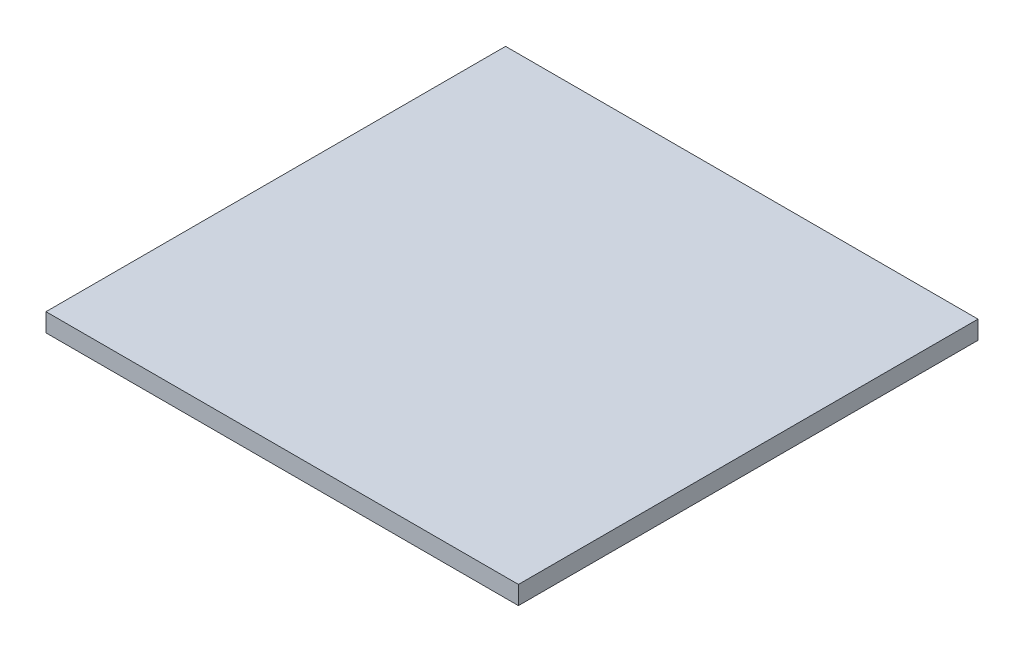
ISO-10303-21;
HEADER;
FILE_DESCRIPTION(('STEP AP214'),'2;1');
FILE_NAME('part.step','',(''),(''),'','','');
FILE_SCHEMA(('AUTOMOTIVE_DESIGN { 1 0 10303 214 1 1 1 1 }'));
ENDSEC;
DATA;
#1=APPLICATION_CONTEXT('core data for automotive mechanical design processes');
#2=APPLICATION_PROTOCOL_DEFINITION('international standard','automotive_design',2000,#1);
#3=PRODUCT_CONTEXT('',#1,'mechanical');
#4=PRODUCT('Part','Part','',(#3));
#5=PRODUCT_RELATED_PRODUCT_CATEGORY('part','',(#4));
#6=PRODUCT_DEFINITION_FORMATION('','',#4);
#7=PRODUCT_DEFINITION_CONTEXT('part definition',#1,'design');
#8=PRODUCT_DEFINITION('design','',#6,#7);
#9=PRODUCT_DEFINITION_SHAPE('','',#8);
#10=(LENGTH_UNIT() NAMED_UNIT(*) SI_UNIT(.MILLI.,.METRE.));
#11=(NAMED_UNIT(*) PLANE_ANGLE_UNIT() SI_UNIT($,.RADIAN.));
#12=(NAMED_UNIT(*) SI_UNIT($,.STERADIAN.) SOLID_ANGLE_UNIT());
#13=UNCERTAINTY_MEASURE_WITH_UNIT(LENGTH_MEASURE(1.E-05),#10,'distance_accuracy_value','');
#14=(GEOMETRIC_REPRESENTATION_CONTEXT(3) GLOBAL_UNCERTAINTY_ASSIGNED_CONTEXT((#13)) GLOBAL_UNIT_ASSIGNED_CONTEXT((#10,
#11,#12)) REPRESENTATION_CONTEXT('',''));
#15=CARTESIAN_POINT('',(0.,0.,0.));
#16=DIRECTION('',(0.,0.,1.));
#17=DIRECTION('',(1.,0.,0.));
#18=AXIS2_PLACEMENT_3D('',#15,#16,#17);
#19=CARTESIAN_POINT('',(-12.9723587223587,1.,15.9103194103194));
#20=DIRECTION('',(1.,0.,0.));
#21=DIRECTION('',(0.,0.,-1.));
#22=AXIS2_PLACEMENT_3D('',#19,#20,#21);
#23=PLANE('',#22);
#24=DIRECTION('',(0.,0.,1.));
#25=VECTOR('',#24,1.);
#26=CARTESIAN_POINT('',(-12.9723587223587,0.,15.9103194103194));
#27=LINE('',#26,#25);
#28=CARTESIAN_POINT('',(-12.9723587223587,0.,-9.08968058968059));
#29=VERTEX_POINT('',#28);
#30=CARTESIAN_POINT('',(-12.9723587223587,0.,15.9103194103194));
#31=VERTEX_POINT('',#30);
#32=EDGE_CURVE('E95',#29,#31,#27,.T.);
#33=ORIENTED_EDGE('',*,*,#32,.T.);
#34=DIRECTION('',(0.,-1.,0.));
#35=VECTOR('',#34,1.);
#36=CARTESIAN_POINT('',(-12.9723587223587,1.,15.9103194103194));
#37=LINE('',#36,#35);
#38=CARTESIAN_POINT('',(-12.9723587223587,1.,15.9103194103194));
#39=VERTEX_POINT('',#38);
#40=EDGE_CURVE('E11',#39,#31,#37,.T.);
#41=ORIENTED_EDGE('',*,*,#40,.F.);
#42=DIRECTION('',(0.,0.,1.));
#43=VECTOR('',#42,1.);
#44=CARTESIAN_POINT('',(-12.9723587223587,1.,15.9103194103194));
#45=LINE('',#44,#43);
#46=CARTESIAN_POINT('',(-12.9723587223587,1.,-9.08968058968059));
#47=VERTEX_POINT('',#46);
#48=EDGE_CURVE('E83',#47,#39,#45,.T.);
#49=ORIENTED_EDGE('',*,*,#48,.F.);
#50=DIRECTION('',(0.,-1.,0.));
#51=VECTOR('',#50,1.);
#52=CARTESIAN_POINT('',(-12.9723587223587,1.,-9.08968058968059));
#53=LINE('',#52,#51);
#54=EDGE_CURVE('E91',#47,#29,#53,.T.);
#55=ORIENTED_EDGE('',*,*,#54,.T.);
#56=EDGE_LOOP('',(#33,#41,#49,#55));
#57=FACE_BOUND('',#56,.T.);
#58=ADVANCED_FACE('F32',(#57),#23,.F.);
#59=CARTESIAN_POINT('',(-12.9723587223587,1.,15.9103194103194));
#60=DIRECTION('',(0.,0.,-1.));
#61=DIRECTION('',(-1.,0.,0.));
#62=AXIS2_PLACEMENT_3D('',#59,#60,#61);
#63=PLANE('',#62);
#64=DIRECTION('',(1.,0.,0.));
#65=VECTOR('',#64,1.);
#66=CARTESIAN_POINT('',(-12.9723587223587,0.,15.9103194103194));
#67=LINE('',#66,#65);
#68=CARTESIAN_POINT('',(12.7276412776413,0.,15.9103194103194));
#69=VERTEX_POINT('',#68);
#70=EDGE_CURVE('E87',#31,#69,#67,.T.);
#71=ORIENTED_EDGE('',*,*,#70,.T.);
#72=DIRECTION('',(0.,-1.,0.));
#73=VECTOR('',#72,1.);
#74=CARTESIAN_POINT('',(12.7276412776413,1.,15.9103194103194));
#75=LINE('',#74,#73);
#76=CARTESIAN_POINT('',(12.7276412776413,1.,15.9103194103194));
#77=VERTEX_POINT('',#76);
#78=EDGE_CURVE('E40',#77,#69,#75,.T.);
#79=ORIENTED_EDGE('',*,*,#78,.F.);
#80=DIRECTION('',(1.,0.,0.));
#81=VECTOR('',#80,1.);
#82=CARTESIAN_POINT('',(-12.9723587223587,1.,15.9103194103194));
#83=LINE('',#82,#81);
#84=EDGE_CURVE('E78',#39,#77,#83,.T.);
#85=ORIENTED_EDGE('',*,*,#84,.F.);
#86=ORIENTED_EDGE('',*,*,#40,.T.);
#87=EDGE_LOOP('',(#71,#79,#85,#86));
#88=FACE_BOUND('',#87,.T.);
#89=ADVANCED_FACE('F86',(#88),#63,.F.);
#90=CARTESIAN_POINT('',(12.7276412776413,1.,15.9103194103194));
#91=DIRECTION('',(-1.,0.,0.));
#92=DIRECTION('',(0.,0.,1.));
#93=AXIS2_PLACEMENT_3D('',#90,#91,#92);
#94=PLANE('',#93);
#95=DIRECTION('',(0.,0.,-1.));
#96=VECTOR('',#95,1.);
#97=CARTESIAN_POINT('',(12.7276412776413,0.,15.9103194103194));
#98=LINE('',#97,#96);
#99=CARTESIAN_POINT('',(12.7276412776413,0.,-9.08968058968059));
#100=VERTEX_POINT('',#99);
#101=EDGE_CURVE('E65',#69,#100,#98,.T.);
#102=ORIENTED_EDGE('',*,*,#101,.T.);
#103=DIRECTION('',(0.,-1.,0.));
#104=VECTOR('',#103,1.);
#105=CARTESIAN_POINT('',(12.7276412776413,1.,-9.08968058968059));
#106=LINE('',#105,#104);
#107=CARTESIAN_POINT('',(12.7276412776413,1.,-9.08968058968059));
#108=VERTEX_POINT('',#107);
#109=EDGE_CURVE('E88',#108,#100,#106,.T.);
#110=ORIENTED_EDGE('',*,*,#109,.F.);
#111=DIRECTION('',(0.,0.,-1.));
#112=VECTOR('',#111,1.);
#113=CARTESIAN_POINT('',(12.7276412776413,1.,15.9103194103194));
#114=LINE('',#113,#112);
#115=EDGE_CURVE('E81',#77,#108,#114,.T.);
#116=ORIENTED_EDGE('',*,*,#115,.F.);
#117=ORIENTED_EDGE('',*,*,#78,.T.);
#118=EDGE_LOOP('',(#102,#110,#116,#117));
#119=FACE_BOUND('',#118,.T.);
#120=ADVANCED_FACE('F89',(#119),#94,.F.);
#121=CARTESIAN_POINT('',(-12.9723587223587,1.,-9.08968058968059));
#122=DIRECTION('',(0.,0.,1.));
#123=DIRECTION('',(1.,0.,0.));
#124=AXIS2_PLACEMENT_3D('',#121,#122,#123);
#125=PLANE('',#124);
#126=DIRECTION('',(-1.,0.,0.));
#127=VECTOR('',#126,1.);
#128=CARTESIAN_POINT('',(-12.9723587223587,0.,-9.08968058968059));
#129=LINE('',#128,#127);
#130=EDGE_CURVE('E71',#100,#29,#129,.T.);
#131=ORIENTED_EDGE('',*,*,#130,.T.);
#132=ORIENTED_EDGE('',*,*,#54,.F.);
#133=DIRECTION('',(-1.,0.,0.));
#134=VECTOR('',#133,1.);
#135=CARTESIAN_POINT('',(-12.9723587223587,1.,-9.08968058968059));
#136=LINE('',#135,#134);
#137=EDGE_CURVE('E48',#108,#47,#136,.T.);
#138=ORIENTED_EDGE('',*,*,#137,.F.);
#139=ORIENTED_EDGE('',*,*,#109,.T.);
#140=EDGE_LOOP('',(#131,#132,#138,#139));
#141=FACE_BOUND('',#140,.T.);
#142=ADVANCED_FACE('F102',(#141),#125,.F.);
#143=CARTESIAN_POINT('',(0.,1.,0.));
#144=DIRECTION('',(0.,-1.,0.));
#145=DIRECTION('',(0.,0.,-1.));
#146=AXIS2_PLACEMENT_3D('',#143,#144,#145);
#147=PLANE('',#146);
#148=ORIENTED_EDGE('',*,*,#48,.T.);
#149=ORIENTED_EDGE('',*,*,#84,.T.);
#150=ORIENTED_EDGE('',*,*,#115,.T.);
#151=ORIENTED_EDGE('',*,*,#137,.T.);
#152=EDGE_LOOP('',(#148,#149,#150,#151));
#153=FACE_BOUND('',#152,.T.);
#154=ADVANCED_FACE('F79',(#153),#147,.F.);
#155=CARTESIAN_POINT('',(0.,0.,0.));
#156=DIRECTION('',(0.,-1.,0.));
#157=DIRECTION('',(0.,0.,-1.));
#158=AXIS2_PLACEMENT_3D('',#155,#156,#157);
#159=PLANE('',#158);
#160=ORIENTED_EDGE('',*,*,#32,.F.);
#161=ORIENTED_EDGE('',*,*,#130,.F.);
#162=ORIENTED_EDGE('',*,*,#101,.F.);
#163=ORIENTED_EDGE('',*,*,#70,.F.);
#164=EDGE_LOOP('',(#160,#161,#162,#163));
#165=FACE_BOUND('',#164,.T.);
#166=ADVANCED_FACE('F105',(#165),#159,.T.);
#167=CLOSED_SHELL('',(#58,#89,#120,#142,#154,#166));
#168=MANIFOLD_SOLID_BREP('B2',#167);
#169=ADVANCED_BREP_SHAPE_REPRESENTATION('',(#18,#168),#14);
#170=SHAPE_DEFINITION_REPRESENTATION(#9,#169);
ENDSEC;
END-ISO-10303-21;
